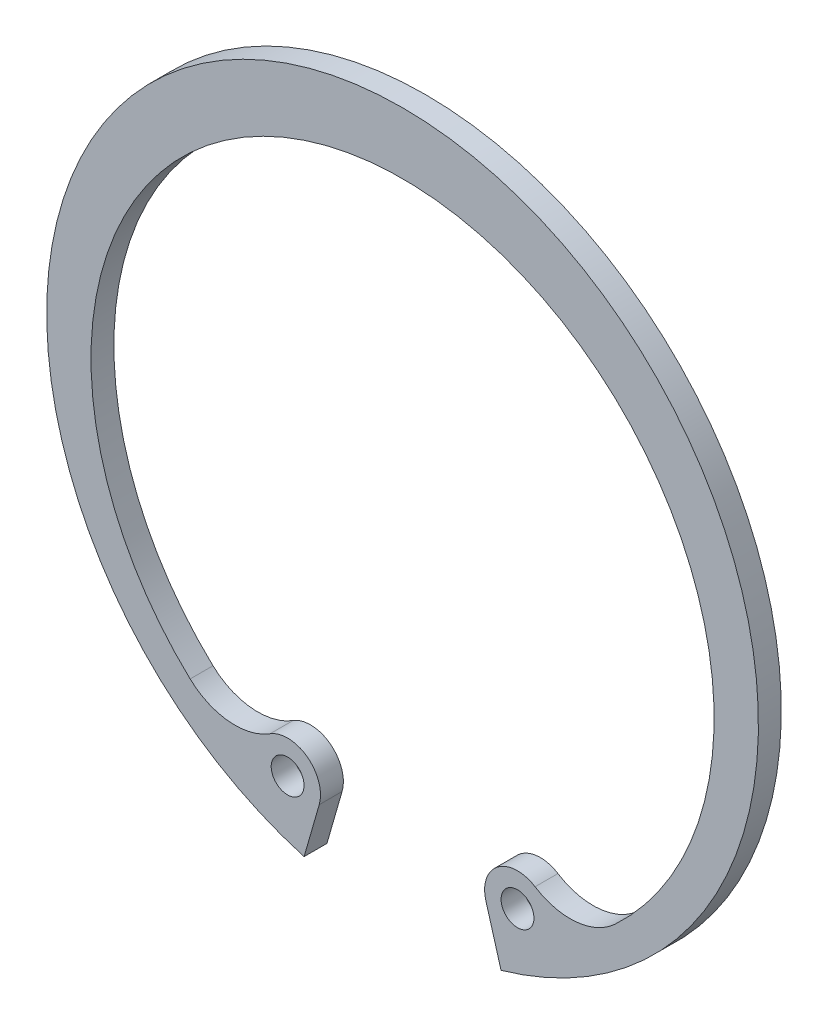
ISO-10303-21;
HEADER;
FILE_DESCRIPTION(('STEP AP214'),'2;1');
FILE_NAME('part.step','',(''),(''),'','','');
FILE_SCHEMA(('AUTOMOTIVE_DESIGN { 1 0 10303 214 1 1 1 1 }'));
ENDSEC;
DATA;
#1=APPLICATION_CONTEXT('core data for automotive mechanical design processes');
#2=APPLICATION_PROTOCOL_DEFINITION('international standard','automotive_design',2000,#1);
#3=PRODUCT_CONTEXT('',#1,'mechanical');
#4=PRODUCT('Part','Part','',(#3));
#5=PRODUCT_RELATED_PRODUCT_CATEGORY('part','',(#4));
#6=PRODUCT_DEFINITION_FORMATION('','',#4);
#7=PRODUCT_DEFINITION_CONTEXT('part definition',#1,'design');
#8=PRODUCT_DEFINITION('design','',#6,#7);
#9=PRODUCT_DEFINITION_SHAPE('','',#8);
#10=(LENGTH_UNIT() NAMED_UNIT(*) SI_UNIT(.MILLI.,.METRE.));
#11=(NAMED_UNIT(*) PLANE_ANGLE_UNIT() SI_UNIT($,.RADIAN.));
#12=(NAMED_UNIT(*) SI_UNIT($,.STERADIAN.) SOLID_ANGLE_UNIT());
#13=UNCERTAINTY_MEASURE_WITH_UNIT(LENGTH_MEASURE(1.E-05),#10,'distance_accuracy_value','');
#14=(GEOMETRIC_REPRESENTATION_CONTEXT(3) GLOBAL_UNCERTAINTY_ASSIGNED_CONTEXT((#13)) GLOBAL_UNIT_ASSIGNED_CONTEXT((#10,
#11,#12)) REPRESENTATION_CONTEXT('',''));
#15=CARTESIAN_POINT('',(0.,0.,0.));
#16=DIRECTION('',(0.,0.,1.));
#17=DIRECTION('',(1.,0.,0.));
#18=AXIS2_PLACEMENT_3D('',#15,#16,#17);
#19=CARTESIAN_POINT('',(0.,0.,-1.6));
#20=DIRECTION('',(0.,0.,1.));
#21=DIRECTION('',(1.,0.,0.));
#22=AXIS2_PLACEMENT_3D('',#19,#20,#21);
#23=CYLINDRICAL_SURFACE('',#22,24.9);
#24=CARTESIAN_POINT('',(0.,0.,0.));
#25=DIRECTION('',(0.,0.,1.));
#26=DIRECTION('',(1.,0.,0.));
#27=AXIS2_PLACEMENT_3D('',#24,#25,#26);
#28=CIRCLE('',#27,24.9);
#29=CARTESIAN_POINT('',(6.89104791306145,-23.9274624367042,0.));
#30=VERTEX_POINT('',#29);
#31=CARTESIAN_POINT('',(-6.89104791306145,-23.9274624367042,0.));
#32=VERTEX_POINT('',#31);
#33=EDGE_CURVE('E92',#30,#32,#28,.T.);
#34=ORIENTED_EDGE('',*,*,#33,.F.);
#35=DIRECTION('',(0.,0.,1.));
#36=VECTOR('',#35,1.);
#37=CARTESIAN_POINT('',(6.89104791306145,-23.9274624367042,-1.6));
#38=LINE('',#37,#36);
#39=CARTESIAN_POINT('',(6.89104791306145,-23.9274624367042,-1.6));
#40=VERTEX_POINT('',#39);
#41=EDGE_CURVE('E11',#40,#30,#38,.T.);
#42=ORIENTED_EDGE('',*,*,#41,.F.);
#43=CARTESIAN_POINT('',(0.,0.,-1.6));
#44=DIRECTION('',(0.,0.,1.));
#45=DIRECTION('',(1.,0.,0.));
#46=AXIS2_PLACEMENT_3D('',#43,#44,#45);
#47=CIRCLE('',#46,24.9);
#48=CARTESIAN_POINT('',(-6.89104791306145,-23.9274624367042,-1.6));
#49=VERTEX_POINT('',#48);
#50=EDGE_CURVE('E94',#40,#49,#47,.T.);
#51=ORIENTED_EDGE('',*,*,#50,.T.);
#52=DIRECTION('',(0.,0.,1.));
#53=VECTOR('',#52,1.);
#54=CARTESIAN_POINT('',(-6.89104791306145,-23.9274624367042,-1.6));
#55=LINE('',#54,#53);
#56=EDGE_CURVE('E31',#49,#32,#55,.T.);
#57=ORIENTED_EDGE('',*,*,#56,.T.);
#58=EDGE_LOOP('',(#34,#42,#51,#57));
#59=FACE_BOUND('',#58,.T.);
#60=ADVANCED_FACE('F28',(#59),#23,.T.);
#61=CARTESIAN_POINT('',(6.89104791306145,-23.9274624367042,-1.6));
#62=DIRECTION('',(-0.960942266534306,-0.276748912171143,0.));
#63=DIRECTION('',(0.276748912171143,-0.960942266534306,0.));
#64=AXIS2_PLACEMENT_3D('',#61,#62,#63);
#65=PLANE('',#64);
#66=DIRECTION('',(0.276748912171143,-0.960942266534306,0.));
#67=VECTOR('',#66,1.);
#68=CARTESIAN_POINT('',(6.89104791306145,-23.9274624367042,0.));
#69=LINE('',#68,#67);
#70=CARTESIAN_POINT('',(5.83244639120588,-20.2517300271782,0.));
#71=VERTEX_POINT('',#70);
#72=EDGE_CURVE('E110',#71,#30,#69,.T.);
#73=ORIENTED_EDGE('',*,*,#72,.F.);
#74=DIRECTION('',(0.,0.,1.));
#75=VECTOR('',#74,1.);
#76=CARTESIAN_POINT('',(5.83244639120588,-20.2517300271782,-1.6));
#77=LINE('',#76,#75);
#78=CARTESIAN_POINT('',(5.83244639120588,-20.2517300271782,-1.6));
#79=VERTEX_POINT('',#78);
#80=EDGE_CURVE('E36',#79,#71,#77,.T.);
#81=ORIENTED_EDGE('',*,*,#80,.F.);
#82=DIRECTION('',(0.276748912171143,-0.960942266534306,0.));
#83=VECTOR('',#82,1.);
#84=CARTESIAN_POINT('',(6.89104791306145,-23.9274624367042,-1.6));
#85=LINE('',#84,#83);
#86=EDGE_CURVE('E99',#79,#40,#85,.T.);
#87=ORIENTED_EDGE('',*,*,#86,.T.);
#88=ORIENTED_EDGE('',*,*,#41,.T.);
#89=EDGE_LOOP('',(#73,#81,#87,#88));
#90=FACE_BOUND('',#89,.T.);
#91=ADVANCED_FACE('F176',(#90),#65,.T.);
#92=CARTESIAN_POINT('',(8.04261360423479,-19.6152075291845,-1.6));
#93=DIRECTION('',(0.,0.,1.));
#94=DIRECTION('',(1.,0.,0.));
#95=AXIS2_PLACEMENT_3D('',#92,#93,#94);
#96=CYLINDRICAL_SURFACE('',#95,2.3);
#97=CARTESIAN_POINT('',(8.04261360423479,-19.6152075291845,0.));
#98=DIRECTION('',(0.,0.,1.));
#99=DIRECTION('',(1.,0.,0.));
#100=AXIS2_PLACEMENT_3D('',#97,#98,#99);
#101=CIRCLE('',#100,2.3);
#102=CARTESIAN_POINT('',(9.27099308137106,-17.6707066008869,0.));
#103=VERTEX_POINT('',#102);
#104=EDGE_CURVE('E128',#103,#71,#101,.T.);
#105=ORIENTED_EDGE('',*,*,#104,.F.);
#106=DIRECTION('',(0.,0.,1.));
#107=VECTOR('',#106,1.);
#108=CARTESIAN_POINT('',(9.27099308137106,-17.6707066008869,-1.6));
#109=LINE('',#108,#107);
#110=CARTESIAN_POINT('',(9.27099308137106,-17.6707066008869,-1.6));
#111=VERTEX_POINT('',#110);
#112=EDGE_CURVE('E150',#111,#103,#109,.T.);
#113=ORIENTED_EDGE('',*,*,#112,.F.);
#114=CARTESIAN_POINT('',(8.04261360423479,-19.6152075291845,-1.6));
#115=DIRECTION('',(0.,0.,1.));
#116=DIRECTION('',(1.,0.,0.));
#117=AXIS2_PLACEMENT_3D('',#114,#115,#116);
#118=CIRCLE('',#117,2.3);
#119=EDGE_CURVE('E146',#111,#79,#118,.T.);
#120=ORIENTED_EDGE('',*,*,#119,.T.);
#121=ORIENTED_EDGE('',*,*,#80,.T.);
#122=EDGE_LOOP('',(#105,#113,#120,#121));
#123=FACE_BOUND('',#122,.T.);
#124=ADVANCED_FACE('F175',(#123),#96,.T.);
#125=CARTESIAN_POINT('',(11.7277520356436,-13.7817047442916,-1.6));
#126=DIRECTION('',(0.,0.,1.));
#127=DIRECTION('',(1.,0.,0.));
#128=AXIS2_PLACEMENT_3D('',#125,#126,#127);
#129=CYLINDRICAL_SURFACE('',#128,4.59999999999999);
#130=CARTESIAN_POINT('',(11.7277520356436,-13.7817047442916,0.));
#131=DIRECTION('',(0.,0.,-1.));
#132=DIRECTION('',(1.,0.,0.));
#133=AXIS2_PLACEMENT_3D('',#130,#131,#132);
#134=CIRCLE('',#133,4.59999999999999);
#135=CARTESIAN_POINT('',(14.8642455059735,-17.1465834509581,0.));
#136=VERTEX_POINT('',#135);
#137=EDGE_CURVE('E125',#136,#103,#134,.T.);
#138=ORIENTED_EDGE('',*,*,#137,.F.);
#139=DIRECTION('',(0.,0.,1.));
#140=VECTOR('',#139,1.);
#141=CARTESIAN_POINT('',(14.8642455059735,-17.1465834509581,-1.6));
#142=LINE('',#141,#140);
#143=CARTESIAN_POINT('',(14.8642455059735,-17.1465834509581,-1.6));
#144=VERTEX_POINT('',#143);
#145=EDGE_CURVE('E152',#144,#136,#142,.T.);
#146=ORIENTED_EDGE('',*,*,#145,.F.);
#147=CARTESIAN_POINT('',(11.7277520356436,-13.7817047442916,-1.6));
#148=DIRECTION('',(0.,0.,-1.));
#149=DIRECTION('',(1.,0.,0.));
#150=AXIS2_PLACEMENT_3D('',#147,#148,#149);
#151=CIRCLE('',#150,4.59999999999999);
#152=EDGE_CURVE('E143',#144,#111,#151,.T.);
#153=ORIENTED_EDGE('',*,*,#152,.T.);
#154=ORIENTED_EDGE('',*,*,#112,.T.);
#155=EDGE_LOOP('',(#138,#146,#153,#154));
#156=FACE_BOUND('',#155,.T.);
#157=ADVANCED_FACE('F171',(#156),#129,.F.);
#158=CARTESIAN_POINT('',(0.,-1.19999096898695,-1.6));
#159=DIRECTION('',(0.,0.,1.));
#160=DIRECTION('',(1.,0.,0.));
#161=AXIS2_PLACEMENT_3D('',#158,#159,#160);
#162=CYLINDRICAL_SURFACE('',#161,21.7999909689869);
#163=CARTESIAN_POINT('',(0.,-1.19999096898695,0.));
#164=DIRECTION('',(0.,0.,-1.));
#165=DIRECTION('',(1.,0.,0.));
#166=AXIS2_PLACEMENT_3D('',#163,#164,#165);
#167=CIRCLE('',#166,21.7999909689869);
#168=CARTESIAN_POINT('',(-14.8642455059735,-17.1465834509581,0.));
#169=VERTEX_POINT('',#168);
#170=EDGE_CURVE('E122',#169,#136,#167,.T.);
#171=ORIENTED_EDGE('',*,*,#170,.F.);
#172=DIRECTION('',(0.,0.,1.));
#173=VECTOR('',#172,1.);
#174=CARTESIAN_POINT('',(-14.8642455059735,-17.1465834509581,-1.6));
#175=LINE('',#174,#173);
#176=CARTESIAN_POINT('',(-14.8642455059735,-17.1465834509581,-1.6));
#177=VERTEX_POINT('',#176);
#178=EDGE_CURVE('E154',#177,#169,#175,.T.);
#179=ORIENTED_EDGE('',*,*,#178,.F.);
#180=CARTESIAN_POINT('',(0.,-1.19999096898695,-1.6));
#181=DIRECTION('',(0.,0.,-1.));
#182=DIRECTION('',(1.,0.,0.));
#183=AXIS2_PLACEMENT_3D('',#180,#181,#182);
#184=CIRCLE('',#183,21.7999909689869);
#185=EDGE_CURVE('E140',#177,#144,#184,.T.);
#186=ORIENTED_EDGE('',*,*,#185,.T.);
#187=ORIENTED_EDGE('',*,*,#145,.T.);
#188=EDGE_LOOP('',(#171,#179,#186,#187));
#189=FACE_BOUND('',#188,.T.);
#190=ADVANCED_FACE('F167',(#189),#162,.F.);
#191=CARTESIAN_POINT('',(-11.7277520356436,-13.7817047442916,-1.6));
#192=DIRECTION('',(0.,0.,1.));
#193=DIRECTION('',(1.,0.,0.));
#194=AXIS2_PLACEMENT_3D('',#191,#192,#193);
#195=CYLINDRICAL_SURFACE('',#194,4.6);
#196=CARTESIAN_POINT('',(-11.7277520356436,-13.7817047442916,0.));
#197=DIRECTION('',(0.,0.,-1.));
#198=DIRECTION('',(1.,0.,0.));
#199=AXIS2_PLACEMENT_3D('',#196,#197,#198);
#200=CIRCLE('',#199,4.6);
#201=CARTESIAN_POINT('',(-9.27099308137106,-17.6707066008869,0.));
#202=VERTEX_POINT('',#201);
#203=EDGE_CURVE('E119',#202,#169,#200,.T.);
#204=ORIENTED_EDGE('',*,*,#203,.F.);
#205=DIRECTION('',(0.,0.,1.));
#206=VECTOR('',#205,1.);
#207=CARTESIAN_POINT('',(-9.27099308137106,-17.6707066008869,-1.6));
#208=LINE('',#207,#206);
#209=CARTESIAN_POINT('',(-9.27099308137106,-17.6707066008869,-1.6));
#210=VERTEX_POINT('',#209);
#211=EDGE_CURVE('E156',#210,#202,#208,.T.);
#212=ORIENTED_EDGE('',*,*,#211,.F.);
#213=CARTESIAN_POINT('',(-11.7277520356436,-13.7817047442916,-1.6));
#214=DIRECTION('',(0.,0.,-1.));
#215=DIRECTION('',(1.,0.,0.));
#216=AXIS2_PLACEMENT_3D('',#213,#214,#215);
#217=CIRCLE('',#216,4.6);
#218=EDGE_CURVE('E137',#210,#177,#217,.T.);
#219=ORIENTED_EDGE('',*,*,#218,.T.);
#220=ORIENTED_EDGE('',*,*,#178,.T.);
#221=EDGE_LOOP('',(#204,#212,#219,#220));
#222=FACE_BOUND('',#221,.T.);
#223=ADVANCED_FACE('F163',(#222),#195,.F.);
#224=CARTESIAN_POINT('',(-8.04261360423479,-19.6152075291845,-1.6));
#225=DIRECTION('',(0.,0.,1.));
#226=DIRECTION('',(1.,0.,0.));
#227=AXIS2_PLACEMENT_3D('',#224,#225,#226);
#228=CYLINDRICAL_SURFACE('',#227,2.3);
#229=CARTESIAN_POINT('',(-8.04261360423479,-19.6152075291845,0.));
#230=DIRECTION('',(0.,0.,1.));
#231=DIRECTION('',(1.,0.,0.));
#232=AXIS2_PLACEMENT_3D('',#229,#230,#231);
#233=CIRCLE('',#232,2.3);
#234=CARTESIAN_POINT('',(-5.83244639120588,-20.2517300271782,0.));
#235=VERTEX_POINT('',#234);
#236=EDGE_CURVE('E106',#235,#202,#233,.T.);
#237=ORIENTED_EDGE('',*,*,#236,.F.);
#238=DIRECTION('',(0.,0.,1.));
#239=VECTOR('',#238,1.);
#240=CARTESIAN_POINT('',(-5.83244639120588,-20.2517300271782,-1.6));
#241=LINE('',#240,#239);
#242=CARTESIAN_POINT('',(-5.83244639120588,-20.2517300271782,-1.6));
#243=VERTEX_POINT('',#242);
#244=EDGE_CURVE('E98',#243,#235,#241,.T.);
#245=ORIENTED_EDGE('',*,*,#244,.F.);
#246=CARTESIAN_POINT('',(-8.04261360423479,-19.6152075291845,-1.6));
#247=DIRECTION('',(0.,0.,1.));
#248=DIRECTION('',(1.,0.,0.));
#249=AXIS2_PLACEMENT_3D('',#246,#247,#248);
#250=CIRCLE('',#249,2.3);
#251=EDGE_CURVE('E134',#243,#210,#250,.T.);
#252=ORIENTED_EDGE('',*,*,#251,.T.);
#253=ORIENTED_EDGE('',*,*,#211,.T.);
#254=EDGE_LOOP('',(#237,#245,#252,#253));
#255=FACE_BOUND('',#254,.T.);
#256=ADVANCED_FACE('F159',(#255),#228,.T.);
#257=CARTESIAN_POINT('',(-6.89104791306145,-23.9274624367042,-1.6));
#258=DIRECTION('',(0.960942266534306,-0.276748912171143,0.));
#259=DIRECTION('',(0.276748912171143,0.960942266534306,0.));
#260=AXIS2_PLACEMENT_3D('',#257,#258,#259);
#261=PLANE('',#260);
#262=DIRECTION('',(0.276748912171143,0.960942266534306,0.));
#263=VECTOR('',#262,1.);
#264=CARTESIAN_POINT('',(-6.89104791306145,-23.9274624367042,0.));
#265=LINE('',#264,#263);
#266=EDGE_CURVE('E101',#32,#235,#265,.T.);
#267=ORIENTED_EDGE('',*,*,#266,.F.);
#268=ORIENTED_EDGE('',*,*,#56,.F.);
#269=DIRECTION('',(0.276748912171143,0.960942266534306,0.));
#270=VECTOR('',#269,1.);
#271=CARTESIAN_POINT('',(-6.89104791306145,-23.9274624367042,-1.6));
#272=LINE('',#271,#270);
#273=EDGE_CURVE('E132',#49,#243,#272,.T.);
#274=ORIENTED_EDGE('',*,*,#273,.T.);
#275=ORIENTED_EDGE('',*,*,#244,.T.);
#276=EDGE_LOOP('',(#267,#268,#274,#275));
#277=FACE_BOUND('',#276,.T.);
#278=ADVANCED_FACE('F102',(#277),#261,.T.);
#279=CARTESIAN_POINT('',(0.,0.,-1.6));
#280=DIRECTION('',(0.,0.,1.));
#281=DIRECTION('',(1.,0.,0.));
#282=AXIS2_PLACEMENT_3D('',#279,#280,#281);
#283=PLANE('',#282);
#284=CARTESIAN_POINT('',(-8.04261360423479,-19.6152075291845,-1.6));
#285=DIRECTION('',(0.,0.,1.));
#286=DIRECTION('',(1.,0.,0.));
#287=AXIS2_PLACEMENT_3D('',#284,#285,#286);
#288=CIRCLE('',#287,1.15);
#289=CARTESIAN_POINT('',(-6.89261360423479,-19.6152075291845,-1.6));
#290=VERTEX_POINT('',#289);
#291=EDGE_CURVE('E242',#290,#290,#288,.T.);
#292=ORIENTED_EDGE('',*,*,#291,.T.);
#293=EDGE_LOOP('',(#292));
#294=FACE_BOUND('',#293,.T.);
#295=CARTESIAN_POINT('',(8.04261360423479,-19.6152075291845,-1.6));
#296=DIRECTION('',(0.,0.,1.));
#297=DIRECTION('',(1.,0.,0.));
#298=AXIS2_PLACEMENT_3D('',#295,#296,#297);
#299=CIRCLE('',#298,1.15);
#300=CARTESIAN_POINT('',(9.19261360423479,-19.6152075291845,-1.6));
#301=VERTEX_POINT('',#300);
#302=EDGE_CURVE('E111',#301,#301,#299,.T.);
#303=ORIENTED_EDGE('',*,*,#302,.T.);
#304=EDGE_LOOP('',(#303));
#305=FACE_BOUND('',#304,.T.);
#306=ORIENTED_EDGE('',*,*,#50,.F.);
#307=ORIENTED_EDGE('',*,*,#86,.F.);
#308=ORIENTED_EDGE('',*,*,#119,.F.);
#309=ORIENTED_EDGE('',*,*,#152,.F.);
#310=ORIENTED_EDGE('',*,*,#185,.F.);
#311=ORIENTED_EDGE('',*,*,#218,.F.);
#312=ORIENTED_EDGE('',*,*,#251,.F.);
#313=ORIENTED_EDGE('',*,*,#273,.F.);
#314=EDGE_LOOP('',(#306,#307,#308,#309,#310,#311,#312,#313));
#315=FACE_BOUND('',#314,.T.);
#316=ADVANCED_FACE('F179',(#294,#305,#315),#283,.F.);
#317=CARTESIAN_POINT('',(0.,0.,0.));
#318=DIRECTION('',(0.,0.,1.));
#319=DIRECTION('',(1.,0.,0.));
#320=AXIS2_PLACEMENT_3D('',#317,#318,#319);
#321=PLANE('',#320);
#322=CARTESIAN_POINT('',(-8.04261360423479,-19.6152075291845,0.));
#323=DIRECTION('',(0.,0.,1.));
#324=DIRECTION('',(1.,0.,0.));
#325=AXIS2_PLACEMENT_3D('',#322,#323,#324);
#326=CIRCLE('',#325,1.15);
#327=CARTESIAN_POINT('',(-6.89261360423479,-19.6152075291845,0.));
#328=VERTEX_POINT('',#327);
#329=EDGE_CURVE('E245',#328,#328,#326,.T.);
#330=ORIENTED_EDGE('',*,*,#329,.F.);
#331=EDGE_LOOP('',(#330));
#332=FACE_BOUND('',#331,.T.);
#333=CARTESIAN_POINT('',(8.04261360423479,-19.6152075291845,0.));
#334=DIRECTION('',(0.,0.,1.));
#335=DIRECTION('',(1.,0.,0.));
#336=AXIS2_PLACEMENT_3D('',#333,#334,#335);
#337=CIRCLE('',#336,1.15);
#338=CARTESIAN_POINT('',(9.19261360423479,-19.6152075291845,0.));
#339=VERTEX_POINT('',#338);
#340=EDGE_CURVE('E114',#339,#339,#337,.T.);
#341=ORIENTED_EDGE('',*,*,#340,.F.);
#342=EDGE_LOOP('',(#341));
#343=FACE_BOUND('',#342,.T.);
#344=ORIENTED_EDGE('',*,*,#33,.T.);
#345=ORIENTED_EDGE('',*,*,#266,.T.);
#346=ORIENTED_EDGE('',*,*,#236,.T.);
#347=ORIENTED_EDGE('',*,*,#203,.T.);
#348=ORIENTED_EDGE('',*,*,#170,.T.);
#349=ORIENTED_EDGE('',*,*,#137,.T.);
#350=ORIENTED_EDGE('',*,*,#104,.T.);
#351=ORIENTED_EDGE('',*,*,#72,.T.);
#352=EDGE_LOOP('',(#344,#345,#346,#347,#348,#349,#350,#351));
#353=FACE_BOUND('',#352,.T.);
#354=ADVANCED_FACE('F108',(#332,#343,#353),#321,.T.);
#355=CARTESIAN_POINT('',(8.04261360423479,-19.6152075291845,-1.6));
#356=DIRECTION('',(0.,0.,1.));
#357=DIRECTION('',(1.,0.,0.));
#358=AXIS2_PLACEMENT_3D('',#355,#356,#357);
#359=CYLINDRICAL_SURFACE('',#358,1.15);
#360=ORIENTED_EDGE('',*,*,#302,.F.);
#361=EDGE_LOOP('',(#360));
#362=FACE_BOUND('',#361,.T.);
#363=ORIENTED_EDGE('',*,*,#340,.T.);
#364=EDGE_LOOP('',(#363));
#365=FACE_BOUND('',#364,.T.);
#366=ADVANCED_FACE('F187',(#362,#365),#359,.F.);
#367=CARTESIAN_POINT('',(-8.04261360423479,-19.6152075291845,-1.6));
#368=DIRECTION('',(0.,0.,1.));
#369=DIRECTION('',(1.,0.,0.));
#370=AXIS2_PLACEMENT_3D('',#367,#368,#369);
#371=CYLINDRICAL_SURFACE('',#370,1.15);
#372=ORIENTED_EDGE('',*,*,#291,.F.);
#373=EDGE_LOOP('',(#372));
#374=FACE_BOUND('',#373,.T.);
#375=ORIENTED_EDGE('',*,*,#329,.T.);
#376=EDGE_LOOP('',(#375));
#377=FACE_BOUND('',#376,.T.);
#378=ADVANCED_FACE('F230',(#374,#377),#371,.F.);
#379=CLOSED_SHELL('',(#60,#91,#124,#157,#190,#223,#256,#278,#316,#354,#366,#378));
#380=MANIFOLD_SOLID_BREP('B2',#379);
#381=ADVANCED_BREP_SHAPE_REPRESENTATION('',(#18,#380),#14);
#382=SHAPE_DEFINITION_REPRESENTATION(#9,#381);
ENDSEC;
END-ISO-10303-21;
